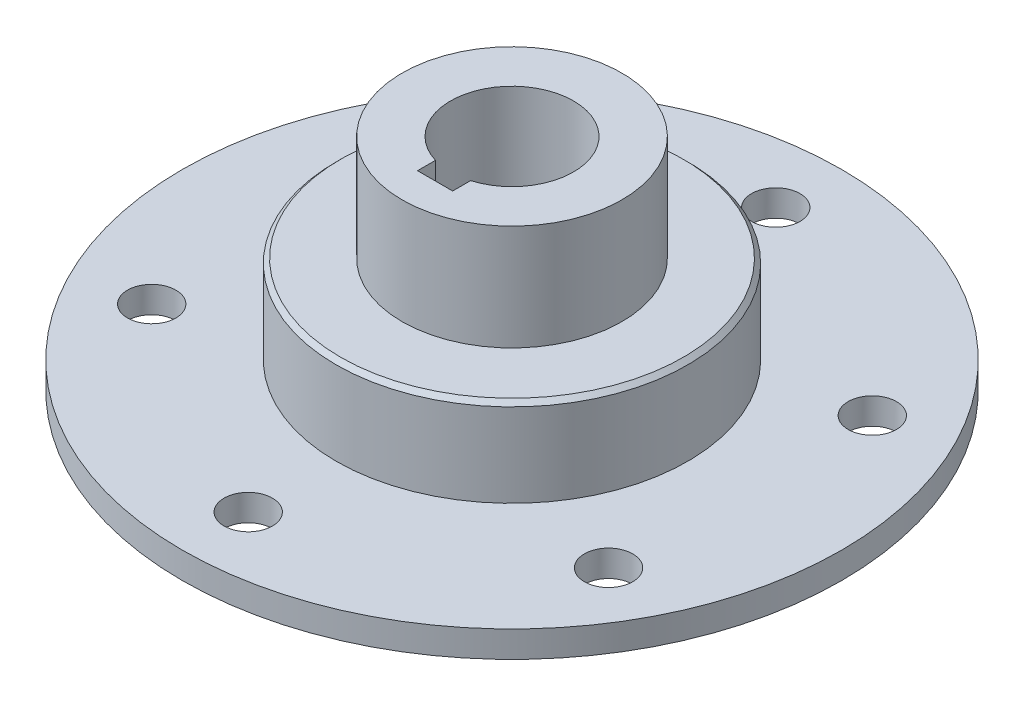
from build123d import *

# Parameters (mm, degrees)
CUT_EXTRUDE_1_DEPTH      = 122.86057607
CHAMFER_1_SIZE           = 1
HOLE_WIZARD_1_D          = 11
PATTERN_CIRCULAR_1_COUNT = 6


with BuildPart() as part:
    # Sketch 1 → Revolve 1 (revolve)
    with BuildSketch(Plane.XY, mode=Mode.PRIVATE) as revolve_1_sk:
        Polygon((0, 30), (0, -30), (-25, -30), (-25, -20), (-75, -20), (-75, -14), (-40, -14), (-40, 6), (-25, 6), (-25, 30), align=None)
    revolve(revolve_1_sk.sketch.rotate(Axis((0, 30, 0), (0, -1, 0)), 270), axis=Axis((0, 30, 0), (0, -1, 0)))

    # Sketch 2 → Cut-Extrude 1 (cut, through all)
    with BuildSketch(Plane.XZ.offset(30)):
        with BuildLine():
            Line((-4, 13.416407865), (-4, 17.5))
            Line((-4, 17.5), (4, 17.5))
            Line((4, 17.5), (4, 13.416407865))
            ThreePointArc((4, 13.416407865), (0, -14), (-4, 13.416407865))
        make_face()
    extrude(amount=-CUT_EXTRUDE_1_DEPTH, mode=Mode.SUBTRACT)

    # Chamfer 1
    chamfer_1_edges = [part.edges().sort_by_distance(p)[0] for p in [
        (0, 6, -40),
    ]]
    chamfer(chamfer_1_edges, length=CHAMFER_1_SIZE)

    # Hole Wizard 1 (through all)
    with Locations(Plane(origin=(0, -14, 0), x_dir=(-1, 0, 0), z_dir=(0, 1, 0))):
        with Locations((0, 60)):
            hole_wizard_1 = Hole(HOLE_WIZARD_1_D / 2)

    # Pattern Circular 1: Hole Wizard 1 ×6 about axis
    pattern_circular_1_axis = Axis((0, 0, 0), (0, 1, 0))
    for i in range(1, PATTERN_CIRCULAR_1_COUNT):
        add(hole_wizard_1.rotate(pattern_circular_1_axis, i * 360 / PATTERN_CIRCULAR_1_COUNT), mode=Mode.SUBTRACT)


solid = part.part
